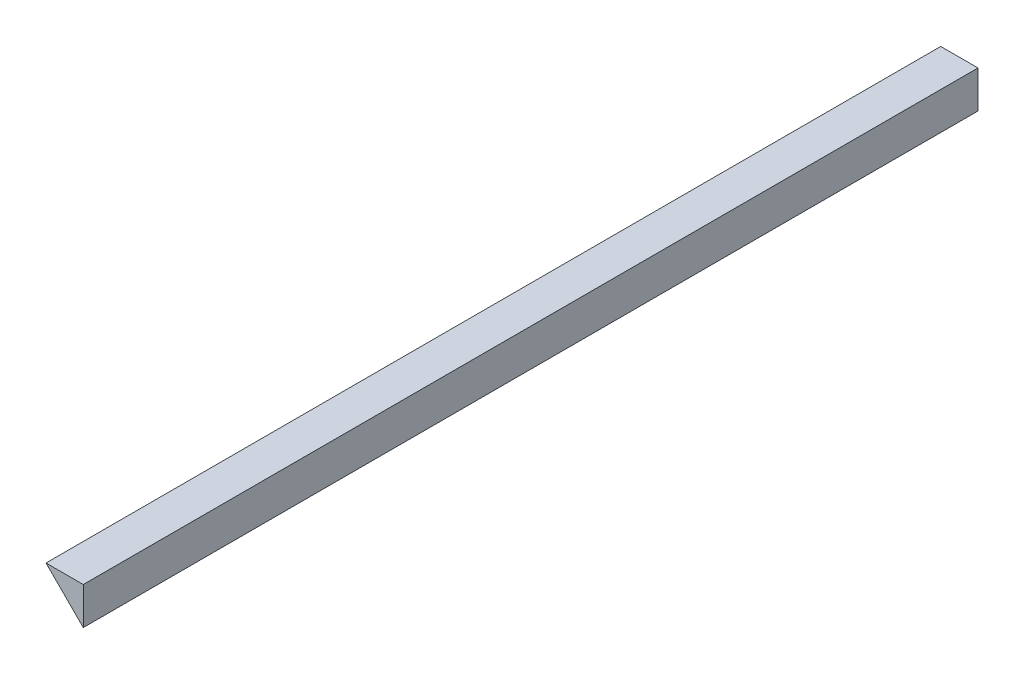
ISO-10303-21;
HEADER;
FILE_DESCRIPTION(('STEP AP214'),'2;1');
FILE_NAME('part.step','',(''),(''),'','','');
FILE_SCHEMA(('AUTOMOTIVE_DESIGN { 1 0 10303 214 1 1 1 1 }'));
ENDSEC;
DATA;
#1=APPLICATION_CONTEXT('core data for automotive mechanical design processes');
#2=APPLICATION_PROTOCOL_DEFINITION('international standard','automotive_design',2000,#1);
#3=PRODUCT_CONTEXT('',#1,'mechanical');
#4=PRODUCT('Part','Part','',(#3));
#5=PRODUCT_RELATED_PRODUCT_CATEGORY('part','',(#4));
#6=PRODUCT_DEFINITION_FORMATION('','',#4);
#7=PRODUCT_DEFINITION_CONTEXT('part definition',#1,'design');
#8=PRODUCT_DEFINITION('design','',#6,#7);
#9=PRODUCT_DEFINITION_SHAPE('','',#8);
#10=(LENGTH_UNIT() NAMED_UNIT(*) SI_UNIT(.MILLI.,.METRE.));
#11=(NAMED_UNIT(*) PLANE_ANGLE_UNIT() SI_UNIT($,.RADIAN.));
#12=(NAMED_UNIT(*) SI_UNIT($,.STERADIAN.) SOLID_ANGLE_UNIT());
#13=UNCERTAINTY_MEASURE_WITH_UNIT(LENGTH_MEASURE(1.E-05),#10,'distance_accuracy_value','');
#14=(GEOMETRIC_REPRESENTATION_CONTEXT(3) GLOBAL_UNCERTAINTY_ASSIGNED_CONTEXT((#13)) GLOBAL_UNIT_ASSIGNED_CONTEXT((#10,
#11,#12)) REPRESENTATION_CONTEXT('',''));
#15=CARTESIAN_POINT('',(0.,0.,0.));
#16=DIRECTION('',(0.,0.,1.));
#17=DIRECTION('',(1.,0.,0.));
#18=AXIS2_PLACEMENT_3D('',#15,#16,#17);
#19=CARTESIAN_POINT('',(374.796,-48.382,120.));
#20=DIRECTION('',(0.,1.,0.));
#21=DIRECTION('',(0.,0.,1.));
#22=AXIS2_PLACEMENT_3D('',#19,#20,#21);
#23=PLANE('',#22);
#24=DIRECTION('',(0.,0.,-1.));
#25=VECTOR('',#24,1.);
#26=CARTESIAN_POINT('',(-454.204,-48.3819999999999,-175.));
#27=LINE('',#26,#25);
#28=CARTESIAN_POINT('',(-454.204,-48.3819999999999,120.));
#29=VERTEX_POINT('',#28);
#30=CARTESIAN_POINT('',(-454.204,-48.3819999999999,-120.));
#31=VERTEX_POINT('',#30);
#32=EDGE_CURVE('E71',#29,#31,#27,.T.);
#33=ORIENTED_EDGE('',*,*,#32,.T.);
#34=DIRECTION('',(-1.,0.,0.));
#35=VECTOR('',#34,1.);
#36=CARTESIAN_POINT('',(374.796,-48.3819999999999,-120.));
#37=LINE('',#36,#35);
#38=CARTESIAN_POINT('',(-464.204,-48.3819999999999,-120.));
#39=VERTEX_POINT('',#38);
#40=EDGE_CURVE('E48',#31,#39,#37,.T.);
#41=ORIENTED_EDGE('',*,*,#40,.T.);
#42=DIRECTION('',(0.,0.,-1.));
#43=VECTOR('',#42,1.);
#44=CARTESIAN_POINT('',(-464.204,-48.382,120.));
#45=LINE('',#44,#43);
#46=CARTESIAN_POINT('',(-464.204,-48.382,120.));
#47=VERTEX_POINT('',#46);
#48=EDGE_CURVE('E35',#47,#39,#45,.T.);
#49=ORIENTED_EDGE('',*,*,#48,.F.);
#50=DIRECTION('',(-1.,0.,0.));
#51=VECTOR('',#50,1.);
#52=CARTESIAN_POINT('',(374.796,-48.382,120.));
#53=LINE('',#52,#51);
#54=EDGE_CURVE('E73',#29,#47,#53,.T.);
#55=ORIENTED_EDGE('',*,*,#54,.F.);
#56=EDGE_LOOP('',(#33,#41,#49,#55));
#57=FACE_BOUND('',#56,.T.);
#58=ADVANCED_FACE('F31',(#57),#23,.T.);
#59=CARTESIAN_POINT('',(-454.204,-48.3819999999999,-120.));
#60=DIRECTION('',(0.,0.,-1.));
#61=DIRECTION('',(0.,1.,0.));
#62=AXIS2_PLACEMENT_3D('',#59,#60,#61);
#63=PLANE('',#62);
#64=ORIENTED_EDGE('',*,*,#40,.F.);
#65=DIRECTION('',(0.,1.,0.));
#66=VECTOR('',#65,1.);
#67=CARTESIAN_POINT('',(-454.204,-48.3820000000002,-120.));
#68=LINE('',#67,#66);
#69=CARTESIAN_POINT('',(-454.204,-58.3819999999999,-120.));
#70=VERTEX_POINT('',#69);
#71=EDGE_CURVE('E54',#70,#31,#68,.T.);
#72=ORIENTED_EDGE('',*,*,#71,.F.);
#73=DIRECTION('',(-0.707106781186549,0.707106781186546,0.));
#74=VECTOR('',#73,1.);
#75=CARTESIAN_POINT('',(-454.204,-58.3819999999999,-120.));
#76=LINE('',#75,#74);
#77=EDGE_CURVE('E67',#70,#39,#76,.T.);
#78=ORIENTED_EDGE('',*,*,#77,.T.);
#79=EDGE_LOOP('',(#64,#72,#78));
#80=FACE_BOUND('',#79,.T.);
#81=ADVANCED_FACE('F65',(#80),#63,.T.);
#82=CARTESIAN_POINT('',(-454.204,-58.3819999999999,-175.));
#83=DIRECTION('',(1.,0.,0.));
#84=DIRECTION('',(0.,1.,0.));
#85=AXIS2_PLACEMENT_3D('',#82,#83,#84);
#86=PLANE('',#85);
#87=ORIENTED_EDGE('',*,*,#71,.T.);
#88=ORIENTED_EDGE('',*,*,#32,.F.);
#89=DIRECTION('',(0.,-1.,0.));
#90=VECTOR('',#89,1.);
#91=CARTESIAN_POINT('',(-454.204,-48.3820000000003,120.));
#92=LINE('',#91,#90);
#93=CARTESIAN_POINT('',(-454.204,-58.3819999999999,120.));
#94=VERTEX_POINT('',#93);
#95=EDGE_CURVE('E81',#29,#94,#92,.T.);
#96=ORIENTED_EDGE('',*,*,#95,.T.);
#97=DIRECTION('',(0.,0.,-1.));
#98=VECTOR('',#97,1.);
#99=CARTESIAN_POINT('',(-454.204,-58.3819999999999,-175.));
#100=LINE('',#99,#98);
#101=EDGE_CURVE('E40',#94,#70,#100,.T.);
#102=ORIENTED_EDGE('',*,*,#101,.T.);
#103=EDGE_LOOP('',(#87,#88,#96,#102));
#104=FACE_BOUND('',#103,.T.);
#105=ADVANCED_FACE('F77',(#104),#86,.T.);
#106=CARTESIAN_POINT('',(-454.204,-48.382,120.));
#107=DIRECTION('',(0.,0.,1.));
#108=DIRECTION('',(0.,-1.,0.));
#109=AXIS2_PLACEMENT_3D('',#106,#107,#108);
#110=PLANE('',#109);
#111=ORIENTED_EDGE('',*,*,#54,.T.);
#112=DIRECTION('',(-0.707106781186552,0.707106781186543,0.));
#113=VECTOR('',#112,1.);
#114=CARTESIAN_POINT('',(-454.204,-58.3819999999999,120.));
#115=LINE('',#114,#113);
#116=EDGE_CURVE('E11',#94,#47,#115,.T.);
#117=ORIENTED_EDGE('',*,*,#116,.F.);
#118=ORIENTED_EDGE('',*,*,#95,.F.);
#119=EDGE_LOOP('',(#111,#117,#118));
#120=FACE_BOUND('',#119,.T.);
#121=ADVANCED_FACE('F87',(#120),#110,.T.);
#122=CARTESIAN_POINT('',(-464.204,-48.3819999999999,-120.));
#123=DIRECTION('',(0.707106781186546,0.707106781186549,0.));
#124=DIRECTION('',(-0.707106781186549,0.707106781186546,0.));
#125=AXIS2_PLACEMENT_3D('',#122,#123,#124);
#126=PLANE('',#125);
#127=ORIENTED_EDGE('',*,*,#48,.T.);
#128=ORIENTED_EDGE('',*,*,#77,.F.);
#129=ORIENTED_EDGE('',*,*,#101,.F.);
#130=ORIENTED_EDGE('',*,*,#116,.T.);
#131=EDGE_LOOP('',(#127,#128,#129,#130));
#132=FACE_BOUND('',#131,.T.);
#133=ADVANCED_FACE('F33',(#132),#126,.F.);
#134=CLOSED_SHELL('',(#58,#81,#105,#121,#133));
#135=MANIFOLD_SOLID_BREP('B2',#134);
#136=ADVANCED_BREP_SHAPE_REPRESENTATION('',(#18,#135),#14);
#137=SHAPE_DEFINITION_REPRESENTATION(#9,#136);
ENDSEC;
END-ISO-10303-21;
